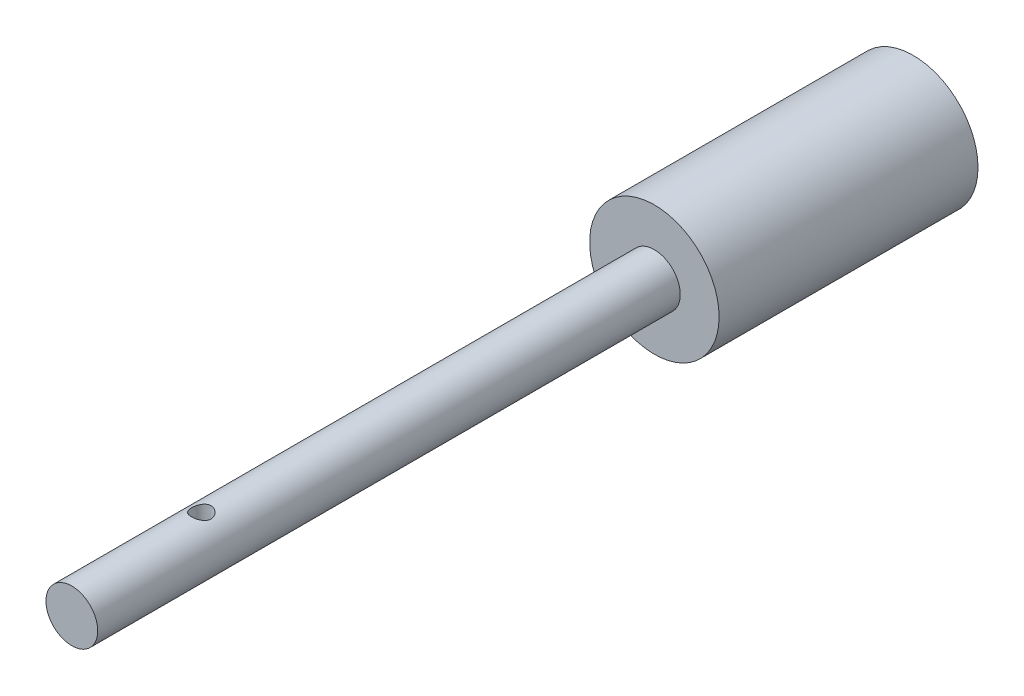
from build123d import *

# Parameters (mm, degrees)
SKETCH1_R               = 5.08
BOSS_EXTRUDE1_DEPTH     = 114.3
BOSS_EXTRUDE2_START     = -50.8
SKETCH1_3_R             = 12.7
SKETCH1_3_R_2           = 5.08
BOSS_EXTRUDE2_DEPTH     = 50.8
CUT_EXTRUDE2_DEPTH      = 116.702506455
CUT_EXTRUDE2_DEPTH_BACK = 116.702506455
SKETCH2_R               = 1.905


with BuildPart() as part:
    # Sketch1 → Boss-Extrude1 (new body)
    with BuildSketch(Plane.XY):
        with Locations(Location((0, 0, 0), (0, 0, 180))):
            Circle(SKETCH1_R)
    extrude(amount=BOSS_EXTRUDE1_DEPTH)

    # Sketch1_3 → Boss-Extrude2 (add)
    # profile 1 of 2: a face of its own
    with BuildSketch(Plane.XY.offset(BOSS_EXTRUDE2_START)):
        Circle(SKETCH1_3_R)
        with Locations(Location((0, 0, 0), (0, 0, 180))):
            Circle(SKETCH1_3_R_2, mode=Mode.SUBTRACT)
    # profile 2 of 2: a face of its own
    with BuildSketch(Plane.XY.offset(BOSS_EXTRUDE2_START)):
        with Locations(Location((0, 0, 0), (0, 0, 180))):
            Circle(SKETCH1_3_R_2)
    extrude(amount=BOSS_EXTRUDE2_DEPTH)

    # Sketch2 → Cut-Extrude2 (cut, two sides: drawn at the far end of the back side and taken through both)
    with BuildSketch(Plane(origin=(0, 0, 0), x_dir=(1, 0, 0), z_dir=(0, 1, 0)).offset(-CUT_EXTRUDE2_DEPTH_BACK)):
        with Locations(Location((0, -88.9, 0), (0, 0, 270))):
            Circle(SKETCH2_R)
    extrude(amount=CUT_EXTRUDE2_DEPTH + CUT_EXTRUDE2_DEPTH_BACK, mode=Mode.SUBTRACT)


solid = part.part
